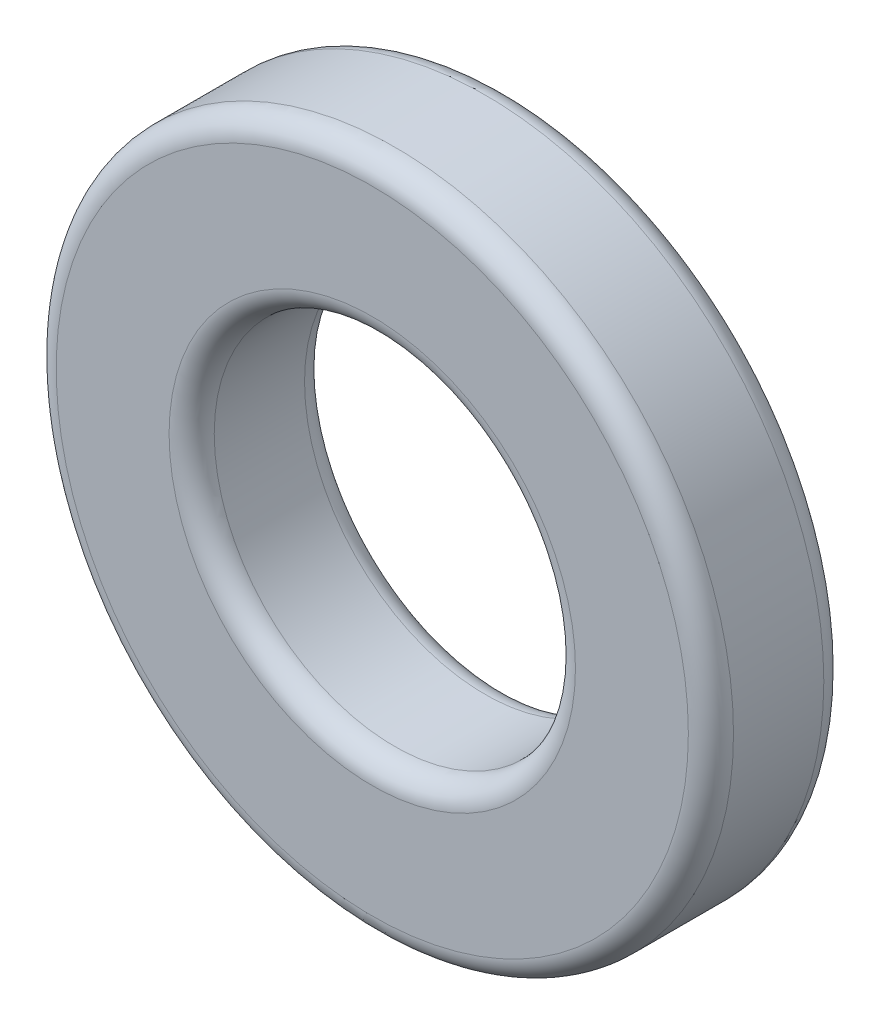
from build123d import *

# Parameters (mm, degrees)
SKETCH_1_R      = 7.5
SKETCH_1_R_2    = 4
EXTRUDE_1_DEPTH = 3
FILLET_1_R      = 0.5


with BuildPart() as part:
    # Sketch 1 → Extrude 1 (new body)
    with BuildSketch(Plane.XY):
        Circle(SKETCH_1_R)
        Circle(SKETCH_1_R_2, mode=Mode.SUBTRACT)
    extrude(amount=EXTRUDE_1_DEPTH)

    # Fillet 1
    fillet_1_edges = [part.edges().sort_by_distance(p)[0] for p in [
        (-7.5, 0, 0),
        (-7.5, 0, 3),
        (-4, 0, 0),
        (-4, 0, 3),
    ]]
    fillet(fillet_1_edges, radius=FILLET_1_R)


solid = part.part
